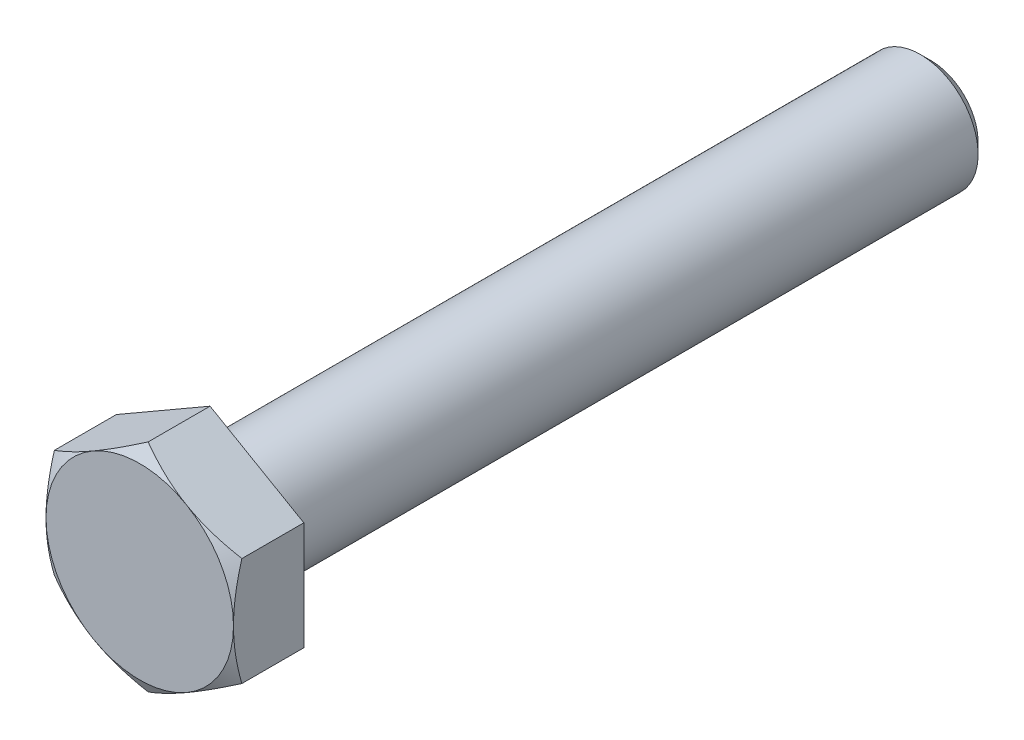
from build123d import *

# Parameters (mm, degrees)
BOSS_EXTRUDE1_DEPTH = 15.478125
SKETCH5_OUTSIDE_W   = 697.14
SKETCH5_OUTSIDE_H   = 703.524
SKETCH5_OUTSIDE_R   = 20.6375
CUT_EXTRUDE1_DEPTH  = 178.057112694
CUT_EXTRUDE1_DRAFT  = -60
CHAMFER1_SIZE       = 0.508


with BuildPart() as part:
    # Sketch3 → Revolve1 (revolve)
    with BuildSketch(Plane(origin=(0, 0, 0), x_dir=(0, 0, -1), z_dir=(1, 0, 0)), mode=Mode.PRIVATE) as revolve1_sk:
        Polygon((-87.1140625, 0), (-87.1140625, 20.6375), (-71.6359375, 20.6375), (-71.6359375, 12.7), (84.7328125, 12.7), (87.1140625, 10.31875), (87.1140625, 0), align=None)
    revolve(revolve1_sk.sketch.rotate(Axis((0, 0, -87.1140625), (0, 0, 1)), 90), axis=Axis((0, 0, -87.1140625), (0, 0, 1)))

    # Sketch4 → Boss-Extrude1 (add)
    with BuildSketch(Plane.XY.offset(87.1140625)):
        Polygon((0, -23.830132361), (20.6375, -11.91506618), (20.6375, 11.91506618), (0, 23.830132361), (-20.6375, 11.91506618), (-20.6375, -11.91506618), align=None)
    extrude(amount=-BOSS_EXTRUDE1_DEPTH)


with BuildPart() as cut_extrude1_tool:
    # Sketch5 outside → Cut-Extrude1 (with draft: the straight prism first)
    with BuildSketch(Plane.XY.offset(87.1140625)):
        Rectangle(SKETCH5_OUTSIDE_W, SKETCH5_OUTSIDE_H)
        Circle(SKETCH5_OUTSIDE_R, mode=Mode.SUBTRACT)
    extrude(amount=-CUT_EXTRUDE1_DEPTH)
    # Cut-Extrude1: the draft: its side faces are tilted about the plane it starts from
    cut_extrude1_sides = [cut_extrude1_tool.faces().sort_by_distance(p)[0] for p in [
        (0, -351.762, -1.914493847),
        (348.57, 0, -1.914493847),
        (0, 351.762, -1.914493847),
        (-348.57, 0, -1.914493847),
        (-20.6375, 0, -1.914493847),
    ]]
    draft(cut_extrude1_sides, Plane.XY.offset(87.1140625), CUT_EXTRUDE1_DRAFT)


with BuildPart() as part_1:
    add(part.part)

    # Cut-Extrude1: cut by cut_extrude1_tool
    add(cut_extrude1_tool.part, mode=Mode.SUBTRACT)

    # Chamfer1
    chamfer1_edges = [part_1.edges().sort_by_distance(p)[0] for p in [
        (12.7, 0, 71.6359375),
    ]]
    chamfer(chamfer1_edges, length=CHAMFER1_SIZE)


solid = part_1.part
